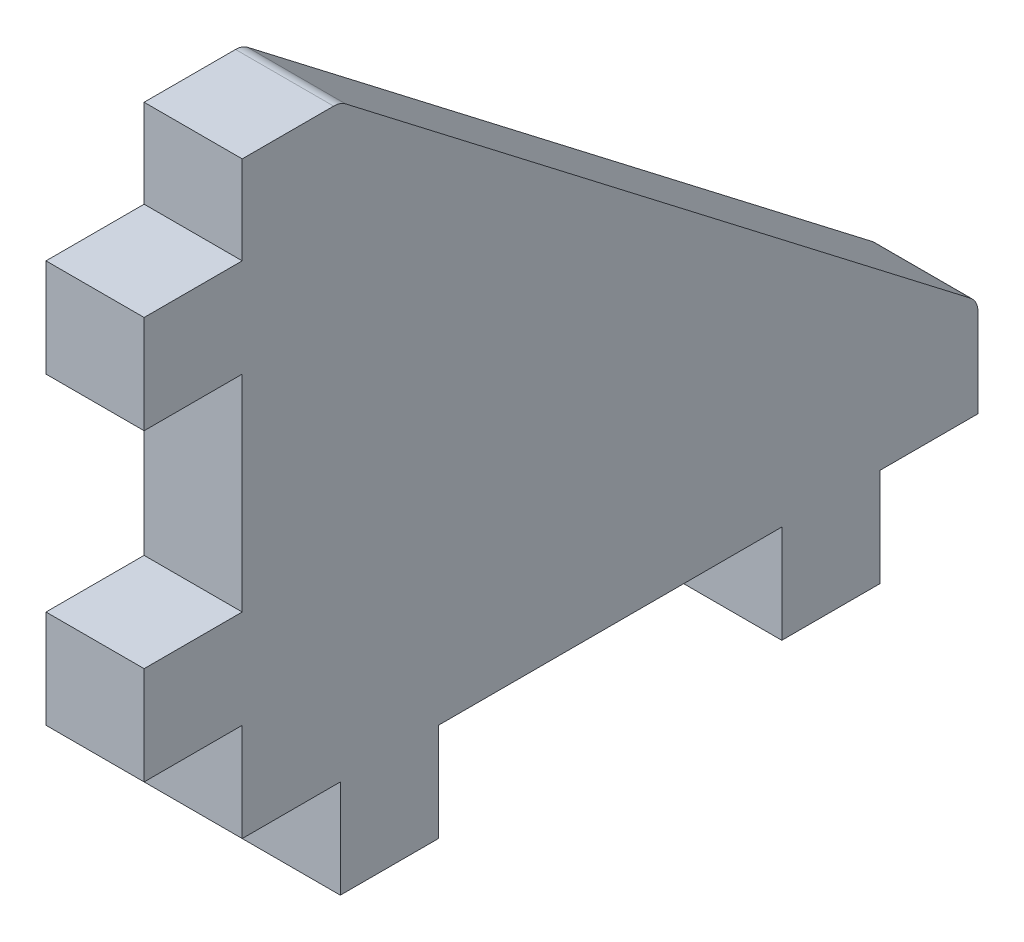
from build123d import *

# Parameters (mm, degrees)
ESTRUSIONE_ESTRUSIONE1_DEPTH = 20
RACCORDO1_R                  = 4


with BuildPart() as part:
    # Schizzo1 → Estrusione-Estrusione1 (new body)
    with BuildSketch(Plane(origin=(0, 0, 0), x_dir=(0, 0, -1), z_dir=(1, 0, 0))):
        Polygon((0, 0), (20, 0), (20, -20), (40, -20), (40, 0), (110, 0), (110, -20), (130, -20), (130, 0), (150, 0), (150, 20), (20, 120), (0, 120), (0, 102), (-20, 102), (-20, 82), (0, 82), (0, 40), (-20, 40), (-20, 20), (0, 20), align=None)
    extrude(amount=ESTRUSIONE_ESTRUSIONE1_DEPTH)

    # Raccordo1
    raccordo1_edges = [part.edges().sort_by_distance(p)[0] for p in [
        (10, 120, -20),
        (10, 20, -150),
    ]]
    fillet(raccordo1_edges, radius=RACCORDO1_R)


solid = part.part
